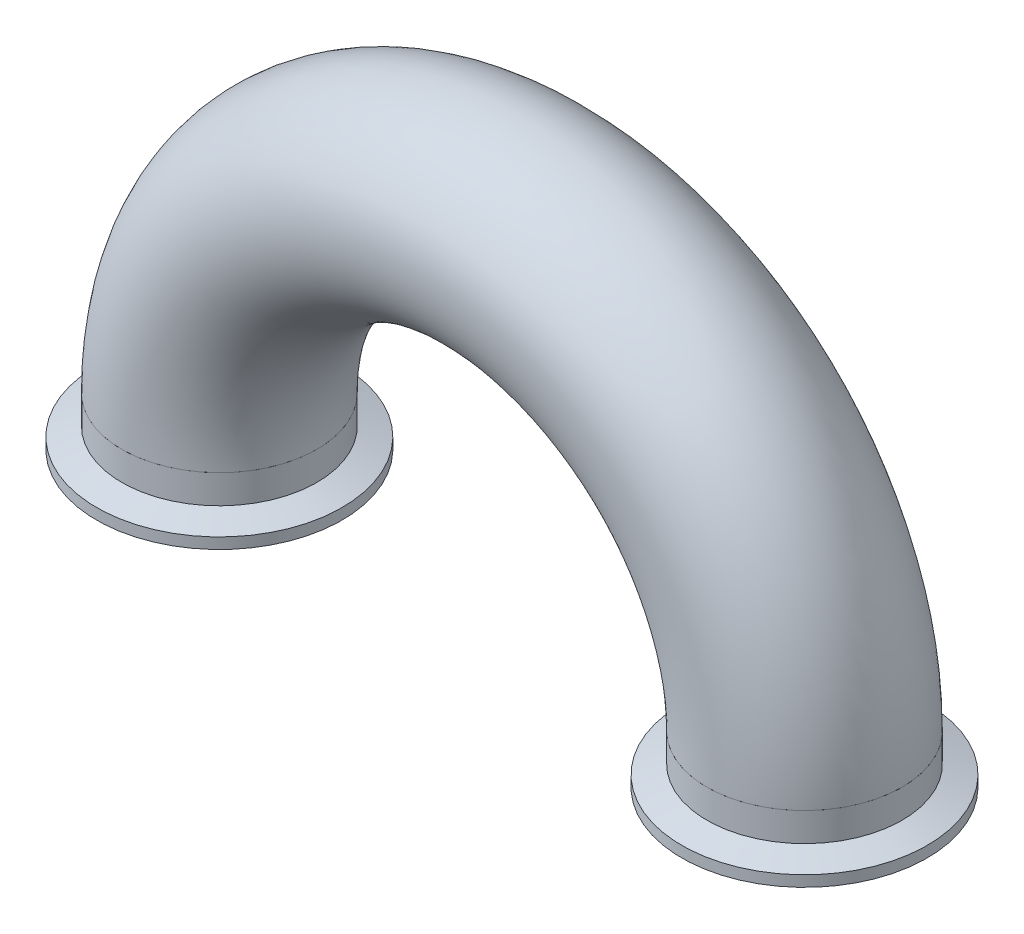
ISO-10303-21;
HEADER;
FILE_DESCRIPTION(('STEP AP214'),'2;1');
FILE_NAME('part.step','',(''),(''),'','','');
FILE_SCHEMA(('AUTOMOTIVE_DESIGN { 1 0 10303 214 1 1 1 1 }'));
ENDSEC;
DATA;
#1=APPLICATION_CONTEXT('core data for automotive mechanical design processes');
#2=APPLICATION_PROTOCOL_DEFINITION('international standard','automotive_design',2000,#1);
#3=PRODUCT_CONTEXT('',#1,'mechanical');
#4=PRODUCT('Part','Part','',(#3));
#5=PRODUCT_RELATED_PRODUCT_CATEGORY('part','',(#4));
#6=PRODUCT_DEFINITION_FORMATION('','',#4);
#7=PRODUCT_DEFINITION_CONTEXT('part definition',#1,'design');
#8=PRODUCT_DEFINITION('design','',#6,#7);
#9=PRODUCT_DEFINITION_SHAPE('','',#8);
#10=(LENGTH_UNIT() NAMED_UNIT(*) SI_UNIT(.MILLI.,.METRE.));
#11=(NAMED_UNIT(*) PLANE_ANGLE_UNIT() SI_UNIT($,.RADIAN.));
#12=(NAMED_UNIT(*) SI_UNIT($,.STERADIAN.) SOLID_ANGLE_UNIT());
#13=UNCERTAINTY_MEASURE_WITH_UNIT(LENGTH_MEASURE(1.E-05),#10,'distance_accuracy_value','');
#14=(GEOMETRIC_REPRESENTATION_CONTEXT(3) GLOBAL_UNCERTAINTY_ASSIGNED_CONTEXT((#13)) GLOBAL_UNIT_ASSIGNED_CONTEXT((#10,
#11,#12)) REPRESENTATION_CONTEXT('',''));
#15=CARTESIAN_POINT('',(0.,0.,0.));
#16=DIRECTION('',(0.,0.,1.));
#17=DIRECTION('',(1.,0.,0.));
#18=AXIS2_PLACEMENT_3D('',#15,#16,#17);
#19=CARTESIAN_POINT('',(153.427342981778,82.1805407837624,162.828279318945));
#20=DIRECTION('',(0.,1.,0.));
#21=DIRECTION('',(0.,0.,1.));
#22=AXIS2_PLACEMENT_3D('',#19,#20,#21);
#23=PLANE('',#22);
#24=CARTESIAN_POINT('',(153.427342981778,82.1805407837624,162.828279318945));
#25=DIRECTION('',(0.,-1.,0.));
#26=DIRECTION('',(0.,0.,-1.));
#27=AXIS2_PLACEMENT_3D('',#24,#25,#26);
#28=CIRCLE('',#27,30.1591722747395);
#29=CARTESIAN_POINT('',(153.427342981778,82.1805407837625,132.669107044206));
#30=VERTEX_POINT('',#29);
#31=EDGE_CURVE('P0_E9',#30,#30,#28,.T.);
#32=ORIENTED_EDGE('',*,*,#31,.F.);
#33=EDGE_LOOP('',(#32));
#34=FACE_BOUND('',#33,.T.);
#35=CARTESIAN_POINT('',(153.427342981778,82.1805407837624,162.828279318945));
#36=DIRECTION('',(0.,-1.,0.));
#37=DIRECTION('',(0.,0.,-1.));
#38=AXIS2_PLACEMENT_3D('',#35,#36,#37);
#39=CIRCLE('',#38,31.9532);
#40=CARTESIAN_POINT('',(153.427342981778,82.1805407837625,130.875079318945));
#41=VERTEX_POINT('',#40);
#42=EDGE_CURVE('P0_E54',#41,#41,#39,.T.);
#43=ORIENTED_EDGE('',*,*,#42,.T.);
#44=EDGE_LOOP('',(#43));
#45=FACE_BOUND('',#44,.T.);
#46=ADVANCED_FACE('P0_F14',(#34,#45),#23,.F.);
#47=CARTESIAN_POINT('',(153.427342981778,82.9679407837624,162.828279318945));
#48=DIRECTION('',(0.,-1.,0.));
#49=DIRECTION('',(0.,0.,-1.));
#50=AXIS2_PLACEMENT_3D('',#47,#48,#49);
#51=TOROIDAL_SURFACE('',#50,30.1591722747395,0.7874);
#52=CARTESIAN_POINT('',(153.427342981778,82.66027909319,162.828279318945));
#53=DIRECTION('',(0.,-1.,0.));
#54=DIRECTION('',(0.,0.,-1.));
#55=AXIS2_PLACEMENT_3D('',#52,#53,#54);
#56=CIRCLE('',#55,29.4343667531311);
#57=CARTESIAN_POINT('',(153.427342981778,82.66027909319,133.393912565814));
#58=VERTEX_POINT('',#57);
#59=EDGE_CURVE('P0_E20',#58,#58,#56,.T.);
#60=ORIENTED_EDGE('',*,*,#59,.F.);
#61=EDGE_LOOP('',(#60));
#62=FACE_BOUND('',#61,.T.);
#63=ORIENTED_EDGE('',*,*,#31,.T.);
#64=EDGE_LOOP('',(#63));
#65=FACE_BOUND('',#64,.T.);
#66=ADVANCED_FACE('P0_F96',(#62,#65),#51,.T.);
#67=CARTESIAN_POINT('',(153.427342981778,83.0533956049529,162.828279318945));
#68=DIRECTION('',(0.,-1.,0.));
#69=DIRECTION('',(0.,0.,-1.));
#70=AXIS2_PLACEMENT_3D('',#67,#68,#69);
#71=CONICAL_SURFACE('',#70,29.2674986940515,0.401425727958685);
#72=ORIENTED_EDGE('',*,*,#59,.T.);
#73=EDGE_LOOP('',(#72));
#74=FACE_BOUND('',#73,.T.);
#75=CARTESIAN_POINT('',(153.427342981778,83.0533956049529,162.828279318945));
#76=DIRECTION('',(0.,-1.,0.));
#77=DIRECTION('',(0.,0.,-1.));
#78=AXIS2_PLACEMENT_3D('',#75,#76,#77);
#79=CIRCLE('',#78,29.2674986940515);
#80=CARTESIAN_POINT('',(153.427342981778,83.0533956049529,133.560780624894));
#81=VERTEX_POINT('',#80);
#82=EDGE_CURVE('P0_E24',#81,#81,#79,.T.);
#83=ORIENTED_EDGE('',*,*,#82,.F.);
#84=EDGE_LOOP('',(#83));
#85=FACE_BOUND('',#84,.T.);
#86=ADVANCED_FACE('P0_F101',(#74,#85),#71,.F.);
#87=CARTESIAN_POINT('',(153.427342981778,82.5869407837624,162.828279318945));
#88=DIRECTION('',(0.,-1.,0.));
#89=DIRECTION('',(0.,0.,-1.));
#90=AXIS2_PLACEMENT_3D('',#87,#88,#89);
#91=TOROIDAL_SURFACE('',#90,28.1686,1.1938);
#92=CARTESIAN_POINT('',(153.427342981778,83.053395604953,162.828279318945));
#93=DIRECTION('',(0.,-1.,0.));
#94=DIRECTION('',(0.,0.,-1.));
#95=AXIS2_PLACEMENT_3D('',#92,#93,#94);
#96=CIRCLE('',#95,27.0697013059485);
#97=CARTESIAN_POINT('',(153.427342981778,83.053395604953,135.758578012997));
#98=VERTEX_POINT('',#97);
#99=EDGE_CURVE('P0_E28',#98,#98,#96,.T.);
#100=ORIENTED_EDGE('',*,*,#99,.F.);
#101=EDGE_LOOP('',(#100));
#102=FACE_BOUND('',#101,.T.);
#103=ORIENTED_EDGE('',*,*,#82,.T.);
#104=EDGE_LOOP('',(#103));
#105=FACE_BOUND('',#104,.T.);
#106=ADVANCED_FACE('P0_F106',(#102,#105),#91,.F.);
#107=CARTESIAN_POINT('',(153.427342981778,83.053395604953,162.828279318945));
#108=DIRECTION('',(0.,1.,0.));
#109=DIRECTION('',(0.,0.,1.));
#110=AXIS2_PLACEMENT_3D('',#107,#108,#109);
#111=CONICAL_SURFACE('',#110,27.0697013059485,0.401425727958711);
#112=CARTESIAN_POINT('',(153.427342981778,82.66027909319,162.828279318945));
#113=DIRECTION('',(0.,-1.,0.));
#114=DIRECTION('',(0.,0.,-1.));
#115=AXIS2_PLACEMENT_3D('',#112,#113,#114);
#116=CIRCLE('',#115,26.9028332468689);
#117=CARTESIAN_POINT('',(153.427342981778,82.66027909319,135.925446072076));
#118=VERTEX_POINT('',#117);
#119=EDGE_CURVE('P0_E33',#118,#118,#116,.T.);
#120=ORIENTED_EDGE('',*,*,#119,.F.);
#121=EDGE_LOOP('',(#120));
#122=FACE_BOUND('',#121,.T.);
#123=ORIENTED_EDGE('',*,*,#99,.T.);
#124=EDGE_LOOP('',(#123));
#125=FACE_BOUND('',#124,.T.);
#126=ADVANCED_FACE('P0_F111',(#122,#125),#111,.T.);
#127=CARTESIAN_POINT('',(153.427342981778,82.9679407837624,162.828279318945));
#128=DIRECTION('',(0.,-1.,0.));
#129=DIRECTION('',(0.,0.,-1.));
#130=AXIS2_PLACEMENT_3D('',#127,#128,#129);
#131=TOROIDAL_SURFACE('',#130,26.1780277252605,0.787399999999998);
#132=ORIENTED_EDGE('',*,*,#119,.T.);
#133=EDGE_LOOP('',(#132));
#134=FACE_BOUND('',#133,.T.);
#135=CARTESIAN_POINT('',(153.427342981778,82.1805407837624,162.828279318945));
#136=DIRECTION('',(0.,-1.,0.));
#137=DIRECTION('',(0.,0.,-1.));
#138=AXIS2_PLACEMENT_3D('',#135,#136,#137);
#139=CIRCLE('',#138,26.1780277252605);
#140=CARTESIAN_POINT('',(153.427342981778,82.1805407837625,136.650251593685));
#141=VERTEX_POINT('',#140);
#142=EDGE_CURVE('P0_E36',#141,#141,#139,.T.);
#143=ORIENTED_EDGE('',*,*,#142,.F.);
#144=EDGE_LOOP('',(#143));
#145=FACE_BOUND('',#144,.T.);
#146=ADVANCED_FACE('P0_F92',(#134,#145),#131,.T.);
#147=CARTESIAN_POINT('',(153.427342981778,82.1805407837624,162.828279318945));
#148=DIRECTION('',(0.,1.,0.));
#149=DIRECTION('',(0.,0.,1.));
#150=AXIS2_PLACEMENT_3D('',#147,#148,#149);
#151=PLANE('',#150);
#152=CARTESIAN_POINT('',(153.427342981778,82.1805407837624,162.828279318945));
#153=DIRECTION('',(0.,-1.,0.));
#154=DIRECTION('',(0.,0.,-1.));
#155=AXIS2_PLACEMENT_3D('',#152,#153,#154);
#156=CIRCLE('',#155,23.749);
#157=CARTESIAN_POINT('',(153.427342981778,82.1805407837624,139.079279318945));
#158=VERTEX_POINT('',#157);
#159=EDGE_CURVE('P0_E39',#158,#158,#156,.T.);
#160=ORIENTED_EDGE('',*,*,#159,.F.);
#161=EDGE_LOOP('',(#160));
#162=FACE_BOUND('',#161,.T.);
#163=ORIENTED_EDGE('',*,*,#142,.T.);
#164=EDGE_LOOP('',(#163));
#165=FACE_BOUND('',#164,.T.);
#166=ADVANCED_FACE('P0_F85',(#162,#165),#151,.F.);
#167=CARTESIAN_POINT('',(153.427342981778,82.1805407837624,162.828279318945));
#168=DIRECTION('',(0.,-1.,0.));
#169=DIRECTION('',(0.,0.,-1.));
#170=AXIS2_PLACEMENT_3D('',#167,#168,#169);
#171=CYLINDRICAL_SURFACE('',#170,23.749);
#172=ORIENTED_EDGE('',*,*,#159,.T.);
#173=EDGE_LOOP('',(#172));
#174=FACE_BOUND('',#173,.T.);
#175=CARTESIAN_POINT('',(153.427342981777,94.8805407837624,162.828279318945));
#176=DIRECTION('',(0.,-1.,0.));
#177=DIRECTION('',(0.,0.,-1.));
#178=AXIS2_PLACEMENT_3D('',#175,#176,#177);
#179=CIRCLE('',#178,23.749);
#180=CARTESIAN_POINT('',(153.427342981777,94.8805407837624,139.079279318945));
#181=VERTEX_POINT('',#180);
#182=EDGE_CURVE('P0_E42',#181,#181,#179,.T.);
#183=ORIENTED_EDGE('',*,*,#182,.F.);
#184=EDGE_LOOP('',(#183));
#185=FACE_BOUND('',#184,.T.);
#186=ADVANCED_FACE('P0_F80',(#174,#185),#171,.F.);
#187=CARTESIAN_POINT('',(153.427342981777,94.8805407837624,162.828279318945));
#188=DIRECTION('',(0.,-1.,0.));
#189=DIRECTION('',(0.,0.,-1.));
#190=AXIS2_PLACEMENT_3D('',#187,#188,#189);
#191=PLANE('',#190);
#192=CARTESIAN_POINT('',(153.427342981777,94.8805407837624,162.828279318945));
#193=DIRECTION('',(0.,-1.,0.));
#194=DIRECTION('',(0.,0.,-1.));
#195=AXIS2_PLACEMENT_3D('',#192,#193,#194);
#196=CIRCLE('',#195,25.4);
#197=CARTESIAN_POINT('',(153.427342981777,94.8805407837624,137.428279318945));
#198=VERTEX_POINT('',#197);
#199=EDGE_CURVE('P0_E45',#198,#198,#196,.T.);
#200=ORIENTED_EDGE('',*,*,#199,.F.);
#201=EDGE_LOOP('',(#200));
#202=FACE_BOUND('',#201,.T.);
#203=ORIENTED_EDGE('',*,*,#182,.T.);
#204=EDGE_LOOP('',(#203));
#205=FACE_BOUND('',#204,.T.);
#206=ADVANCED_FACE('P0_F74',(#202,#205),#191,.F.);
#207=CARTESIAN_POINT('',(153.427342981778,82.1805407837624,162.828279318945));
#208=DIRECTION('',(0.,-1.,0.));
#209=DIRECTION('',(0.,0.,-1.));
#210=AXIS2_PLACEMENT_3D('',#207,#208,#209);
#211=CYLINDRICAL_SURFACE('',#210,25.4);
#212=CARTESIAN_POINT('',(153.427342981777,87.4105105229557,162.828279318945));
#213=DIRECTION('',(0.,-1.,0.));
#214=DIRECTION('',(0.,0.,-1.));
#215=AXIS2_PLACEMENT_3D('',#212,#213,#214);
#216=CIRCLE('',#215,25.4);
#217=CARTESIAN_POINT('',(153.427342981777,87.4105105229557,137.428279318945));
#218=VERTEX_POINT('',#217);
#219=EDGE_CURVE('P0_E48',#218,#218,#216,.T.);
#220=ORIENTED_EDGE('',*,*,#219,.F.);
#221=EDGE_LOOP('',(#220));
#222=FACE_BOUND('',#221,.T.);
#223=ORIENTED_EDGE('',*,*,#199,.T.);
#224=EDGE_LOOP('',(#223));
#225=FACE_BOUND('',#224,.T.);
#226=ADVANCED_FACE('P0_F68',(#222,#225),#211,.T.);
#227=CARTESIAN_POINT('',(153.427342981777,87.4105105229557,162.828279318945));
#228=DIRECTION('',(0.,-1.,0.));
#229=DIRECTION('',(0.,0.,-1.));
#230=AXIS2_PLACEMENT_3D('',#227,#228,#229);
#231=CONICAL_SURFACE('',#230,25.4,1.22173047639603);
#232=CARTESIAN_POINT('',(153.427342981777,85.0253407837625,162.828279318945));
#233=DIRECTION('',(0.,-1.,0.));
#234=DIRECTION('',(0.,0.,-1.));
#235=AXIS2_PLACEMENT_3D('',#232,#233,#234);
#236=CIRCLE('',#235,31.9532);
#237=CARTESIAN_POINT('',(153.427342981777,85.0253407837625,130.875079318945));
#238=VERTEX_POINT('',#237);
#239=EDGE_CURVE('P0_E51',#238,#238,#236,.T.);
#240=ORIENTED_EDGE('',*,*,#239,.F.);
#241=EDGE_LOOP('',(#240));
#242=FACE_BOUND('',#241,.T.);
#243=ORIENTED_EDGE('',*,*,#219,.T.);
#244=EDGE_LOOP('',(#243));
#245=FACE_BOUND('',#244,.T.);
#246=ADVANCED_FACE('P0_F62',(#242,#245),#231,.T.);
#247=CARTESIAN_POINT('',(153.427342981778,82.1805407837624,162.828279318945));
#248=DIRECTION('',(0.,-1.,0.));
#249=DIRECTION('',(0.,0.,-1.));
#250=AXIS2_PLACEMENT_3D('',#247,#248,#249);
#251=CYLINDRICAL_SURFACE('',#250,31.9532);
#252=ORIENTED_EDGE('',*,*,#42,.F.);
#253=EDGE_LOOP('',(#252));
#254=FACE_BOUND('',#253,.T.);
#255=ORIENTED_EDGE('',*,*,#239,.T.);
#256=EDGE_LOOP('',(#255));
#257=FACE_BOUND('',#256,.T.);
#258=ADVANCED_FACE('P0_F59',(#254,#257),#251,.T.);
#259=CLOSED_SHELL('',(#46,#66,#86,#106,#126,#146,#166,#186,#206,#226,#246,#258));
#260=MANIFOLD_SOLID_BREP('P0_B1',#259);
#261=CARTESIAN_POINT('',(1.02734298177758,82.1805407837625,162.828279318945));
#262=DIRECTION('',(0.,1.,0.));
#263=DIRECTION('',(0.,0.,1.));
#264=AXIS2_PLACEMENT_3D('',#261,#262,#263);
#265=PLANE('',#264);
#266=CARTESIAN_POINT('',(1.02734298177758,82.1805407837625,162.828279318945));
#267=DIRECTION('',(0.,-1.,0.));
#268=DIRECTION('',(0.,0.,-1.));
#269=AXIS2_PLACEMENT_3D('',#266,#267,#268);
#270=CIRCLE('',#269,30.1591722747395);
#271=CARTESIAN_POINT('',(1.02734298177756,82.1805407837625,132.669107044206));
#272=VERTEX_POINT('',#271);
#273=EDGE_CURVE('P1_E10',#272,#272,#270,.T.);
#274=ORIENTED_EDGE('',*,*,#273,.F.);
#275=EDGE_LOOP('',(#274));
#276=FACE_BOUND('',#275,.T.);
#277=CARTESIAN_POINT('',(1.02734298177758,82.1805407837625,162.828279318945));
#278=DIRECTION('',(0.,-1.,0.));
#279=DIRECTION('',(0.,0.,-1.));
#280=AXIS2_PLACEMENT_3D('',#277,#278,#279);
#281=CIRCLE('',#280,31.9532);
#282=CARTESIAN_POINT('',(1.02734298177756,82.1805407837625,130.875079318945));
#283=VERTEX_POINT('',#282);
#284=EDGE_CURVE('P1_E55',#283,#283,#281,.T.);
#285=ORIENTED_EDGE('',*,*,#284,.T.);
#286=EDGE_LOOP('',(#285));
#287=FACE_BOUND('',#286,.T.);
#288=ADVANCED_FACE('P1_F15',(#276,#287),#265,.F.);
#289=CARTESIAN_POINT('',(1.02734298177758,82.9679407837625,162.828279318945));
#290=DIRECTION('',(0.,-1.,0.));
#291=DIRECTION('',(0.,0.,-1.));
#292=AXIS2_PLACEMENT_3D('',#289,#290,#291);
#293=TOROIDAL_SURFACE('',#292,30.1591722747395,0.7874);
#294=CARTESIAN_POINT('',(1.02734298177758,82.66027909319,162.828279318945));
#295=DIRECTION('',(0.,-1.,0.));
#296=DIRECTION('',(0.,0.,-1.));
#297=AXIS2_PLACEMENT_3D('',#294,#295,#296);
#298=CIRCLE('',#297,29.4343667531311);
#299=CARTESIAN_POINT('',(1.02734298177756,82.66027909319,133.393912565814));
#300=VERTEX_POINT('',#299);
#301=EDGE_CURVE('P1_E21',#300,#300,#298,.T.);
#302=ORIENTED_EDGE('',*,*,#301,.F.);
#303=EDGE_LOOP('',(#302));
#304=FACE_BOUND('',#303,.T.);
#305=ORIENTED_EDGE('',*,*,#273,.T.);
#306=EDGE_LOOP('',(#305));
#307=FACE_BOUND('',#306,.T.);
#308=ADVANCED_FACE('P1_F97',(#304,#307),#293,.T.);
#309=CARTESIAN_POINT('',(1.02734298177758,83.053395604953,162.828279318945));
#310=DIRECTION('',(0.,-1.,0.));
#311=DIRECTION('',(0.,0.,-1.));
#312=AXIS2_PLACEMENT_3D('',#309,#310,#311);
#313=CONICAL_SURFACE('',#312,29.2674986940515,0.401425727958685);
#314=ORIENTED_EDGE('',*,*,#301,.T.);
#315=EDGE_LOOP('',(#314));
#316=FACE_BOUND('',#315,.T.);
#317=CARTESIAN_POINT('',(1.02734298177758,83.053395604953,162.828279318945));
#318=DIRECTION('',(0.,-1.,0.));
#319=DIRECTION('',(0.,0.,-1.));
#320=AXIS2_PLACEMENT_3D('',#317,#318,#319);
#321=CIRCLE('',#320,29.2674986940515);
#322=CARTESIAN_POINT('',(1.02734298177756,83.053395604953,133.560780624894));
#323=VERTEX_POINT('',#322);
#324=EDGE_CURVE('P1_E25',#323,#323,#321,.T.);
#325=ORIENTED_EDGE('',*,*,#324,.F.);
#326=EDGE_LOOP('',(#325));
#327=FACE_BOUND('',#326,.T.);
#328=ADVANCED_FACE('P1_F102',(#316,#327),#313,.F.);
#329=CARTESIAN_POINT('',(1.02734298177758,82.5869407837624,162.828279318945));
#330=DIRECTION('',(0.,-1.,0.));
#331=DIRECTION('',(0.,0.,-1.));
#332=AXIS2_PLACEMENT_3D('',#329,#330,#331);
#333=TOROIDAL_SURFACE('',#332,28.1686,1.1938);
#334=CARTESIAN_POINT('',(1.02734298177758,83.053395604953,162.828279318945));
#335=DIRECTION('',(0.,-1.,0.));
#336=DIRECTION('',(0.,0.,-1.));
#337=AXIS2_PLACEMENT_3D('',#334,#335,#336);
#338=CIRCLE('',#337,27.0697013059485);
#339=CARTESIAN_POINT('',(1.02734298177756,83.053395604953,135.758578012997));
#340=VERTEX_POINT('',#339);
#341=EDGE_CURVE('P1_E29',#340,#340,#338,.T.);
#342=ORIENTED_EDGE('',*,*,#341,.F.);
#343=EDGE_LOOP('',(#342));
#344=FACE_BOUND('',#343,.T.);
#345=ORIENTED_EDGE('',*,*,#324,.T.);
#346=EDGE_LOOP('',(#345));
#347=FACE_BOUND('',#346,.T.);
#348=ADVANCED_FACE('P1_F107',(#344,#347),#333,.F.);
#349=CARTESIAN_POINT('',(1.02734298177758,83.053395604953,162.828279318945));
#350=DIRECTION('',(0.,1.,0.));
#351=DIRECTION('',(0.,0.,1.));
#352=AXIS2_PLACEMENT_3D('',#349,#350,#351);
#353=CONICAL_SURFACE('',#352,27.0697013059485,0.401425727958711);
#354=CARTESIAN_POINT('',(1.02734298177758,82.66027909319,162.828279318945));
#355=DIRECTION('',(0.,-1.,0.));
#356=DIRECTION('',(0.,0.,-1.));
#357=AXIS2_PLACEMENT_3D('',#354,#355,#356);
#358=CIRCLE('',#357,26.9028332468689);
#359=CARTESIAN_POINT('',(1.02734298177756,82.66027909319,135.925446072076));
#360=VERTEX_POINT('',#359);
#361=EDGE_CURVE('P1_E34',#360,#360,#358,.T.);
#362=ORIENTED_EDGE('',*,*,#361,.F.);
#363=EDGE_LOOP('',(#362));
#364=FACE_BOUND('',#363,.T.);
#365=ORIENTED_EDGE('',*,*,#341,.T.);
#366=EDGE_LOOP('',(#365));
#367=FACE_BOUND('',#366,.T.);
#368=ADVANCED_FACE('P1_F112',(#364,#367),#353,.T.);
#369=CARTESIAN_POINT('',(1.02734298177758,82.9679407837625,162.828279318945));
#370=DIRECTION('',(0.,-1.,0.));
#371=DIRECTION('',(0.,0.,-1.));
#372=AXIS2_PLACEMENT_3D('',#369,#370,#371);
#373=TOROIDAL_SURFACE('',#372,26.1780277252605,0.787399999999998);
#374=ORIENTED_EDGE('',*,*,#361,.T.);
#375=EDGE_LOOP('',(#374));
#376=FACE_BOUND('',#375,.T.);
#377=CARTESIAN_POINT('',(1.02734298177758,82.1805407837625,162.828279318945));
#378=DIRECTION('',(0.,-1.,0.));
#379=DIRECTION('',(0.,0.,-1.));
#380=AXIS2_PLACEMENT_3D('',#377,#378,#379);
#381=CIRCLE('',#380,26.1780277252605);
#382=CARTESIAN_POINT('',(1.02734298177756,82.1805407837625,136.650251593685));
#383=VERTEX_POINT('',#382);
#384=EDGE_CURVE('P1_E37',#383,#383,#381,.T.);
#385=ORIENTED_EDGE('',*,*,#384,.F.);
#386=EDGE_LOOP('',(#385));
#387=FACE_BOUND('',#386,.T.);
#388=ADVANCED_FACE('P1_F93',(#376,#387),#373,.T.);
#389=CARTESIAN_POINT('',(1.02734298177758,82.1805407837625,162.828279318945));
#390=DIRECTION('',(0.,1.,0.));
#391=DIRECTION('',(0.,0.,1.));
#392=AXIS2_PLACEMENT_3D('',#389,#390,#391);
#393=PLANE('',#392);
#394=CARTESIAN_POINT('',(1.02734298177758,82.1805407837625,162.828279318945));
#395=DIRECTION('',(0.,-1.,0.));
#396=DIRECTION('',(0.,0.,-1.));
#397=AXIS2_PLACEMENT_3D('',#394,#395,#396);
#398=CIRCLE('',#397,23.749);
#399=CARTESIAN_POINT('',(1.02734298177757,82.1805407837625,139.079279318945));
#400=VERTEX_POINT('',#399);
#401=EDGE_CURVE('P1_E40',#400,#400,#398,.T.);
#402=ORIENTED_EDGE('',*,*,#401,.F.);
#403=EDGE_LOOP('',(#402));
#404=FACE_BOUND('',#403,.T.);
#405=ORIENTED_EDGE('',*,*,#384,.T.);
#406=EDGE_LOOP('',(#405));
#407=FACE_BOUND('',#406,.T.);
#408=ADVANCED_FACE('P1_F86',(#404,#407),#393,.F.);
#409=CARTESIAN_POINT('',(1.02734298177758,82.1805407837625,162.828279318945));
#410=DIRECTION('',(0.,-1.,0.));
#411=DIRECTION('',(0.,0.,-1.));
#412=AXIS2_PLACEMENT_3D('',#409,#410,#411);
#413=CYLINDRICAL_SURFACE('',#412,23.749);
#414=ORIENTED_EDGE('',*,*,#401,.T.);
#415=EDGE_LOOP('',(#414));
#416=FACE_BOUND('',#415,.T.);
#417=CARTESIAN_POINT('',(1.02734298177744,94.8805407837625,162.828279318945));
#418=DIRECTION('',(0.,-1.,0.));
#419=DIRECTION('',(0.,0.,-1.));
#420=AXIS2_PLACEMENT_3D('',#417,#418,#419);
#421=CIRCLE('',#420,23.749);
#422=CARTESIAN_POINT('',(1.02734298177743,94.8805407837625,139.079279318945));
#423=VERTEX_POINT('',#422);
#424=EDGE_CURVE('P1_E43',#423,#423,#421,.T.);
#425=ORIENTED_EDGE('',*,*,#424,.F.);
#426=EDGE_LOOP('',(#425));
#427=FACE_BOUND('',#426,.T.);
#428=ADVANCED_FACE('P1_F81',(#416,#427),#413,.F.);
#429=CARTESIAN_POINT('',(1.02734298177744,94.8805407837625,162.828279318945));
#430=DIRECTION('',(0.,-1.,0.));
#431=DIRECTION('',(0.,0.,-1.));
#432=AXIS2_PLACEMENT_3D('',#429,#430,#431);
#433=PLANE('',#432);
#434=CARTESIAN_POINT('',(1.02734298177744,94.8805407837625,162.828279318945));
#435=DIRECTION('',(0.,-1.,0.));
#436=DIRECTION('',(0.,0.,-1.));
#437=AXIS2_PLACEMENT_3D('',#434,#435,#436);
#438=CIRCLE('',#437,25.4);
#439=CARTESIAN_POINT('',(1.02734298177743,94.8805407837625,137.428279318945));
#440=VERTEX_POINT('',#439);
#441=EDGE_CURVE('P1_E46',#440,#440,#438,.T.);
#442=ORIENTED_EDGE('',*,*,#441,.F.);
#443=EDGE_LOOP('',(#442));
#444=FACE_BOUND('',#443,.T.);
#445=ORIENTED_EDGE('',*,*,#424,.T.);
#446=EDGE_LOOP('',(#445));
#447=FACE_BOUND('',#446,.T.);
#448=ADVANCED_FACE('P1_F75',(#444,#447),#433,.F.);
#449=CARTESIAN_POINT('',(1.02734298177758,82.1805407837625,162.828279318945));
#450=DIRECTION('',(0.,-1.,0.));
#451=DIRECTION('',(0.,0.,-1.));
#452=AXIS2_PLACEMENT_3D('',#449,#450,#451);
#453=CYLINDRICAL_SURFACE('',#452,25.4);
#454=CARTESIAN_POINT('',(1.02734298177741,87.4105105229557,162.828279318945));
#455=DIRECTION('',(0.,-1.,0.));
#456=DIRECTION('',(0.,0.,-1.));
#457=AXIS2_PLACEMENT_3D('',#454,#455,#456);
#458=CIRCLE('',#457,25.4);
#459=CARTESIAN_POINT('',(1.0273429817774,87.4105105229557,137.428279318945));
#460=VERTEX_POINT('',#459);
#461=EDGE_CURVE('P1_E49',#460,#460,#458,.T.);
#462=ORIENTED_EDGE('',*,*,#461,.F.);
#463=EDGE_LOOP('',(#462));
#464=FACE_BOUND('',#463,.T.);
#465=ORIENTED_EDGE('',*,*,#441,.T.);
#466=EDGE_LOOP('',(#465));
#467=FACE_BOUND('',#466,.T.);
#468=ADVANCED_FACE('P1_F69',(#464,#467),#453,.T.);
#469=CARTESIAN_POINT('',(1.02734298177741,87.4105105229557,162.828279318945));
#470=DIRECTION('',(0.,-1.,0.));
#471=DIRECTION('',(0.,0.,-1.));
#472=AXIS2_PLACEMENT_3D('',#469,#470,#471);
#473=CONICAL_SURFACE('',#472,25.4,1.22173047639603);
#474=CARTESIAN_POINT('',(1.02734298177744,85.0253407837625,162.828279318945));
#475=DIRECTION('',(0.,-1.,0.));
#476=DIRECTION('',(0.,0.,-1.));
#477=AXIS2_PLACEMENT_3D('',#474,#475,#476);
#478=CIRCLE('',#477,31.9532);
#479=CARTESIAN_POINT('',(1.02734298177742,85.0253407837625,130.875079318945));
#480=VERTEX_POINT('',#479);
#481=EDGE_CURVE('P1_E52',#480,#480,#478,.T.);
#482=ORIENTED_EDGE('',*,*,#481,.F.);
#483=EDGE_LOOP('',(#482));
#484=FACE_BOUND('',#483,.T.);
#485=ORIENTED_EDGE('',*,*,#461,.T.);
#486=EDGE_LOOP('',(#485));
#487=FACE_BOUND('',#486,.T.);
#488=ADVANCED_FACE('P1_F63',(#484,#487),#473,.T.);
#489=CARTESIAN_POINT('',(1.02734298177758,82.1805407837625,162.828279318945));
#490=DIRECTION('',(0.,-1.,0.));
#491=DIRECTION('',(0.,0.,-1.));
#492=AXIS2_PLACEMENT_3D('',#489,#490,#491);
#493=CYLINDRICAL_SURFACE('',#492,31.9532);
#494=ORIENTED_EDGE('',*,*,#284,.F.);
#495=EDGE_LOOP('',(#494));
#496=FACE_BOUND('',#495,.T.);
#497=ORIENTED_EDGE('',*,*,#481,.T.);
#498=EDGE_LOOP('',(#497));
#499=FACE_BOUND('',#498,.T.);
#500=ADVANCED_FACE('P1_F60',(#496,#499),#493,.T.);
#501=CLOSED_SHELL('',(#288,#308,#328,#348,#368,#388,#408,#428,#448,#468,#488,#500));
#502=MANIFOLD_SOLID_BREP('P1_B1',#501);
#503=CARTESIAN_POINT('',(77.2273429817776,94.8805407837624,162.828279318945));
#504=DIRECTION('',(0.,0.,-1.));
#505=DIRECTION('',(-1.,0.,0.));
#506=AXIS2_PLACEMENT_3D('',#503,#504,#505);
#507=TOROIDAL_SURFACE('',#506,76.2,25.4);
#508=CARTESIAN_POINT('',(1.02734298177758,94.8805407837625,162.828279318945));
#509=DIRECTION('',(0.,-1.,0.));
#510=DIRECTION('',(0.,0.,1.));
#511=AXIS2_PLACEMENT_3D('',#508,#509,#510);
#512=CIRCLE('',#511,25.4);
#513=CARTESIAN_POINT('',(-24.3726570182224,94.8805407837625,162.828279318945));
#514=VERTEX_POINT('',#513);
#515=EDGE_CURVE('P2_E10',#514,#514,#512,.T.);
#516=CARTESIAN_POINT('',(153.427342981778,94.8805407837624,162.828279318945));
#517=DIRECTION('',(0.,1.,0.));
#518=DIRECTION('',(0.,0.,1.));
#519=AXIS2_PLACEMENT_3D('',#516,#517,#518);
#520=CIRCLE('',#519,25.4);
#521=CARTESIAN_POINT('',(178.827342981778,94.8805407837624,162.828279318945));
#522=VERTEX_POINT('',#521);
#523=EDGE_CURVE('P2_E21',#522,#522,#520,.T.);
#524=CARTESIAN_POINT('',(77.2273429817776,94.8805407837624,162.828279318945));
#525=DIRECTION('',(0.,0.,-1.));
#526=DIRECTION('',(-1.,0.,0.));
#527=AXIS2_PLACEMENT_3D('',#524,#525,#526);
#528=CIRCLE('',#527,101.6);
#529=EDGE_CURVE('',#514,#522,#528,.T.);
#530=ORIENTED_EDGE('',*,*,#515,.F.);
#531=ORIENTED_EDGE('',*,*,#523,.T.);
#532=ORIENTED_EDGE('',*,*,#529,.T.);
#533=ORIENTED_EDGE('',*,*,#529,.F.);
#534=EDGE_LOOP('',(#530,#532,#531,#533));
#535=FACE_BOUND('',#534,.T.);
#536=ADVANCED_FACE('P2_F15',(#535),#507,.T.);
#537=CARTESIAN_POINT('',(1.02734298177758,94.8805407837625,162.828279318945));
#538=DIRECTION('',(0.,-1.,0.));
#539=DIRECTION('',(0.,0.,1.));
#540=AXIS2_PLACEMENT_3D('',#537,#538,#539);
#541=PLANE('',#540);
#542=CARTESIAN_POINT('',(1.02734298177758,94.8805407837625,162.828279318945));
#543=DIRECTION('',(0.,-1.,0.));
#544=DIRECTION('',(1.,0.,0.));
#545=AXIS2_PLACEMENT_3D('',#542,#543,#544);
#546=CIRCLE('',#545,23.749);
#547=CARTESIAN_POINT('',(-22.7216570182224,94.8805407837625,162.828279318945));
#548=VERTEX_POINT('',#547);
#549=EDGE_CURVE('P2_E25',#548,#548,#546,.T.);
#550=ORIENTED_EDGE('',*,*,#549,.F.);
#551=EDGE_LOOP('',(#550));
#552=FACE_BOUND('',#551,.T.);
#553=ORIENTED_EDGE('',*,*,#515,.T.);
#554=EDGE_LOOP('',(#553));
#555=FACE_BOUND('',#554,.T.);
#556=ADVANCED_FACE('P2_F46',(#552,#555),#541,.T.);
#557=CARTESIAN_POINT('',(153.427342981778,94.8805407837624,162.828279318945));
#558=DIRECTION('',(0.,1.,0.));
#559=DIRECTION('',(0.,0.,1.));
#560=AXIS2_PLACEMENT_3D('',#557,#558,#559);
#561=PLANE('',#560);
#562=CARTESIAN_POINT('',(153.427342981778,94.8805407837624,162.828279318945));
#563=DIRECTION('',(0.,1.,0.));
#564=DIRECTION('',(0.,0.,1.));
#565=AXIS2_PLACEMENT_3D('',#562,#563,#564);
#566=CIRCLE('',#565,23.749);
#567=CARTESIAN_POINT('',(177.176342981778,94.8805407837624,162.828279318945));
#568=VERTEX_POINT('',#567);
#569=EDGE_CURVE('P2_E29',#568,#568,#566,.T.);
#570=ORIENTED_EDGE('',*,*,#569,.T.);
#571=EDGE_LOOP('',(#570));
#572=FACE_BOUND('',#571,.T.);
#573=ORIENTED_EDGE('',*,*,#523,.F.);
#574=EDGE_LOOP('',(#573));
#575=FACE_BOUND('',#574,.T.);
#576=ADVANCED_FACE('P2_F35',(#572,#575),#561,.F.);
#577=CARTESIAN_POINT('',(77.2273429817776,94.8805407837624,162.828279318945));
#578=DIRECTION('',(0.,0.,-1.));
#579=DIRECTION('',(-1.,0.,0.));
#580=AXIS2_PLACEMENT_3D('',#577,#578,#579);
#581=TOROIDAL_SURFACE('',#580,76.2,23.749);
#582=CARTESIAN_POINT('',(77.2273429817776,94.8805407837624,162.828279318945));
#583=DIRECTION('',(0.,0.,-1.));
#584=DIRECTION('',(-1.,0.,0.));
#585=AXIS2_PLACEMENT_3D('',#582,#583,#584);
#586=CIRCLE('',#585,99.949);
#587=EDGE_CURVE('',#548,#568,#586,.T.);
#588=ORIENTED_EDGE('',*,*,#549,.T.);
#589=ORIENTED_EDGE('',*,*,#569,.F.);
#590=ORIENTED_EDGE('',*,*,#587,.T.);
#591=ORIENTED_EDGE('',*,*,#587,.F.);
#592=EDGE_LOOP('',(#588,#590,#589,#591));
#593=FACE_BOUND('',#592,.T.);
#594=ADVANCED_FACE('P2_F38',(#593),#581,.F.);
#595=CLOSED_SHELL('',(#536,#556,#576,#594));
#596=MANIFOLD_SOLID_BREP('P2_B1',#595);
#597=ADVANCED_BREP_SHAPE_REPRESENTATION('',(#18,#260,#502,#596),#14);
#598=SHAPE_DEFINITION_REPRESENTATION(#9,#597);
ENDSEC;
END-ISO-10303-21;
